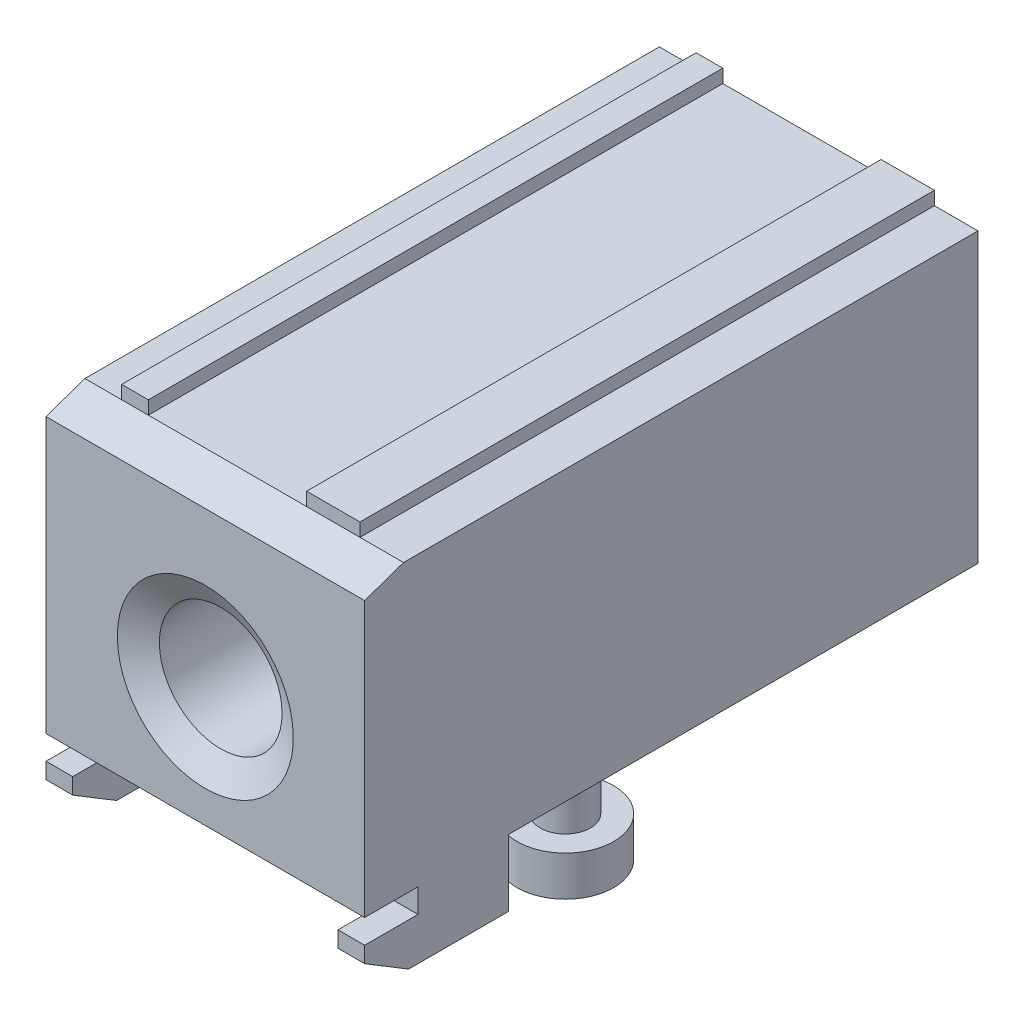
ISO-10303-21;
HEADER;
FILE_DESCRIPTION(('STEP AP214'),'2;1');
FILE_NAME('part.step','',(''),(''),'','','');
FILE_SCHEMA(('AUTOMOTIVE_DESIGN { 1 0 10303 214 1 1 1 1 }'));
ENDSEC;
DATA;
#1=APPLICATION_CONTEXT('core data for automotive mechanical design processes');
#2=APPLICATION_PROTOCOL_DEFINITION('international standard','automotive_design',2000,#1);
#3=PRODUCT_CONTEXT('',#1,'mechanical');
#4=PRODUCT('Part','Part','',(#3));
#5=PRODUCT_RELATED_PRODUCT_CATEGORY('part','',(#4));
#6=PRODUCT_DEFINITION_FORMATION('','',#4);
#7=PRODUCT_DEFINITION_CONTEXT('part definition',#1,'design');
#8=PRODUCT_DEFINITION('design','',#6,#7);
#9=PRODUCT_DEFINITION_SHAPE('','',#8);
#10=(LENGTH_UNIT() NAMED_UNIT(*) SI_UNIT(.MILLI.,.METRE.));
#11=(NAMED_UNIT(*) PLANE_ANGLE_UNIT() SI_UNIT($,.RADIAN.));
#12=(NAMED_UNIT(*) SI_UNIT($,.STERADIAN.) SOLID_ANGLE_UNIT());
#13=UNCERTAINTY_MEASURE_WITH_UNIT(LENGTH_MEASURE(1.E-05),#10,'distance_accuracy_value','');
#14=(GEOMETRIC_REPRESENTATION_CONTEXT(3) GLOBAL_UNCERTAINTY_ASSIGNED_CONTEXT((#13)) GLOBAL_UNIT_ASSIGNED_CONTEXT((#10,
#11,#12)) REPRESENTATION_CONTEXT('',''));
#15=CARTESIAN_POINT('',(0.,0.,0.));
#16=DIRECTION('',(0.,0.,1.));
#17=DIRECTION('',(1.,0.,0.));
#18=AXIS2_PLACEMENT_3D('',#15,#16,#17);
#19=CARTESIAN_POINT('',(-5.975,0.,9.5));
#20=DIRECTION('',(0.,1.,0.));
#21=DIRECTION('',(0.,0.,1.));
#22=AXIS2_PLACEMENT_3D('',#19,#20,#21);
#23=PLANE('',#22);
#24=CARTESIAN_POINT('',(-4.,0.,0.));
#25=DIRECTION('',(0.,1.,0.));
#26=DIRECTION('',(0.,0.,1.));
#27=AXIS2_PLACEMENT_3D('',#24,#25,#26);
#28=CIRCLE('',#27,0.94);
#29=CARTESIAN_POINT('',(-4.,0.,0.94));
#30=VERTEX_POINT('',#29);
#31=EDGE_CURVE('E23',#30,#30,#28,.F.);
#32=ORIENTED_EDGE('',*,*,#31,.F.);
#33=EDGE_LOOP('',(#32));
#34=FACE_BOUND('',#33,.T.);
#35=CARTESIAN_POINT('',(0.,0.,0.));
#36=DIRECTION('',(0.,1.,0.));
#37=DIRECTION('',(0.,0.,1.));
#38=AXIS2_PLACEMENT_3D('',#35,#36,#37);
#39=CIRCLE('',#38,1.025);
#40=CARTESIAN_POINT('',(0.,0.,1.025));
#41=VERTEX_POINT('',#40);
#42=EDGE_CURVE('E558',#41,#41,#39,.F.);
#43=ORIENTED_EDGE('',*,*,#42,.F.);
#44=EDGE_LOOP('',(#43));
#45=FACE_BOUND('',#44,.T.);
#46=DIRECTION('',(-1.,0.,0.));
#47=VECTOR('',#46,1.);
#48=CARTESIAN_POINT('',(-4.975,0.,7.5));
#49=LINE('',#48,#47);
#50=CARTESIAN_POINT('',(-4.975,0.,7.5));
#51=VERTEX_POINT('',#50);
#52=CARTESIAN_POINT('',(-5.975,0.,7.5));
#53=VERTEX_POINT('',#52);
#54=EDGE_CURVE('E312',#51,#53,#49,.T.);
#55=ORIENTED_EDGE('',*,*,#54,.F.);
#56=DIRECTION('',(0.,0.,1.));
#57=VECTOR('',#56,1.);
#58=CARTESIAN_POINT('',(-4.975,0.,7.5));
#59=LINE('',#58,#57);
#60=CARTESIAN_POINT('',(-4.975,0.,4.1));
#61=VERTEX_POINT('',#60);
#62=EDGE_CURVE('E438',#61,#51,#59,.T.);
#63=ORIENTED_EDGE('',*,*,#62,.F.);
#64=DIRECTION('',(-1.,0.,0.));
#65=VECTOR('',#64,1.);
#66=CARTESIAN_POINT('',(-4.975,0.,4.1));
#67=LINE('',#66,#65);
#68=CARTESIAN_POINT('',(-5.975,0.,4.1));
#69=VERTEX_POINT('',#68);
#70=EDGE_CURVE('E336',#61,#69,#67,.T.);
#71=ORIENTED_EDGE('',*,*,#70,.T.);
#72=DIRECTION('',(0.,0.,1.));
#73=VECTOR('',#72,1.);
#74=CARTESIAN_POINT('',(-5.975,0.,-13.5));
#75=LINE('',#74,#73);
#76=CARTESIAN_POINT('',(-5.975,0.,-13.5));
#77=VERTEX_POINT('',#76);
#78=EDGE_CURVE('E290',#77,#69,#75,.T.);
#79=ORIENTED_EDGE('',*,*,#78,.F.);
#80=DIRECTION('',(-1.,0.,0.));
#81=VECTOR('',#80,1.);
#82=CARTESIAN_POINT('',(-5.975,0.,-13.5));
#83=LINE('',#82,#81);
#84=CARTESIAN_POINT('',(5.975,0.,-13.5));
#85=VERTEX_POINT('',#84);
#86=EDGE_CURVE('E233',#85,#77,#83,.T.);
#87=ORIENTED_EDGE('',*,*,#86,.F.);
#88=DIRECTION('',(0.,0.,-1.));
#89=VECTOR('',#88,1.);
#90=CARTESIAN_POINT('',(5.975,0.,-13.5));
#91=LINE('',#90,#89);
#92=CARTESIAN_POINT('',(5.975,0.,4.1));
#93=VERTEX_POINT('',#92);
#94=EDGE_CURVE('E234',#93,#85,#91,.T.);
#95=ORIENTED_EDGE('',*,*,#94,.F.);
#96=DIRECTION('',(1.,0.,0.));
#97=VECTOR('',#96,1.);
#98=CARTESIAN_POINT('',(4.975,0.,4.1));
#99=LINE('',#98,#97);
#100=CARTESIAN_POINT('',(4.975,0.,4.1));
#101=VERTEX_POINT('',#100);
#102=EDGE_CURVE('E276',#101,#93,#99,.T.);
#103=ORIENTED_EDGE('',*,*,#102,.F.);
#104=DIRECTION('',(0.,0.,1.));
#105=VECTOR('',#104,1.);
#106=CARTESIAN_POINT('',(4.975,0.,7.5));
#107=LINE('',#106,#105);
#108=CARTESIAN_POINT('',(4.975,0.,7.5));
#109=VERTEX_POINT('',#108);
#110=EDGE_CURVE('E272',#101,#109,#107,.T.);
#111=ORIENTED_EDGE('',*,*,#110,.T.);
#112=DIRECTION('',(1.,0.,0.));
#113=VECTOR('',#112,1.);
#114=CARTESIAN_POINT('',(4.975,0.,7.5));
#115=LINE('',#114,#113);
#116=CARTESIAN_POINT('',(5.975,0.,7.5));
#117=VERTEX_POINT('',#116);
#118=EDGE_CURVE('E280',#109,#117,#115,.T.);
#119=ORIENTED_EDGE('',*,*,#118,.T.);
#120=CARTESIAN_POINT('',(5.975,0.,9.5));
#121=VERTEX_POINT('',#120);
#122=EDGE_CURVE('E230',#121,#117,#91,.T.);
#123=ORIENTED_EDGE('',*,*,#122,.F.);
#124=DIRECTION('',(1.,0.,0.));
#125=VECTOR('',#124,1.);
#126=CARTESIAN_POINT('',(-5.975,0.,9.5));
#127=LINE('',#126,#125);
#128=CARTESIAN_POINT('',(-5.975,0.,9.5));
#129=VERTEX_POINT('',#128);
#130=EDGE_CURVE('E218',#129,#121,#127,.T.);
#131=ORIENTED_EDGE('',*,*,#130,.F.);
#132=EDGE_CURVE('E278',#53,#129,#75,.T.);
#133=ORIENTED_EDGE('',*,*,#132,.F.);
#134=EDGE_LOOP('',(#55,#63,#71,#79,#87,#95,#103,#111,#119,#123,#131,#133));
#135=FACE_BOUND('',#134,.T.);
#136=CARTESIAN_POINT('',(0.,0.,-5.88));
#137=DIRECTION('',(0.,1.,0.));
#138=DIRECTION('',(0.,0.,1.));
#139=AXIS2_PLACEMENT_3D('',#136,#137,#138);
#140=CIRCLE('',#139,1.025);
#141=CARTESIAN_POINT('',(0.,0.,-4.855));
#142=VERTEX_POINT('',#141);
#143=EDGE_CURVE('E561',#142,#142,#140,.F.);
#144=ORIENTED_EDGE('',*,*,#143,.F.);
#145=EDGE_LOOP('',(#144));
#146=FACE_BOUND('',#145,.T.);
#147=CARTESIAN_POINT('',(4.,0.,0.));
#148=DIRECTION('',(0.,1.,0.));
#149=DIRECTION('',(0.,0.,1.));
#150=AXIS2_PLACEMENT_3D('',#147,#148,#149);
#151=CIRCLE('',#150,0.94);
#152=CARTESIAN_POINT('',(4.,0.,0.940000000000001));
#153=VERTEX_POINT('',#152);
#154=EDGE_CURVE('E10',#153,#153,#151,.F.);
#155=ORIENTED_EDGE('',*,*,#154,.F.);
#156=EDGE_LOOP('',(#155));
#157=FACE_BOUND('',#156,.T.);
#158=ADVANCED_FACE('F15',(#34,#45,#135,#146,#157),#23,.F.);
#159=CARTESIAN_POINT('',(-5.975,10.8,9.5));
#160=DIRECTION('',(0.,1.,0.));
#161=DIRECTION('',(0.,0.,1.));
#162=AXIS2_PLACEMENT_3D('',#159,#160,#161);
#163=PLANE('',#162);
#164=DIRECTION('',(1.,0.,0.));
#165=VECTOR('',#164,1.);
#166=CARTESIAN_POINT('',(-5.975025,10.8,8.04206000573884));
#167=LINE('',#166,#165);
#168=CARTESIAN_POINT('',(-3.59489631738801,10.8,8.04206000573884));
#169=VERTEX_POINT('',#168);
#170=CARTESIAN_POINT('',(2.3401880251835,10.8,8.04206000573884));
#171=VERTEX_POINT('',#170);
#172=EDGE_CURVE('E922',#169,#171,#167,.T.);
#173=ORIENTED_EDGE('',*,*,#172,.T.);
#174=DIRECTION('',(0.,0.,1.));
#175=VECTOR('',#174,1.);
#176=CARTESIAN_POINT('',(2.3401880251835,10.8,-14.6180339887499));
#177=LINE('',#176,#175);
#178=CARTESIAN_POINT('',(2.3401880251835,10.8,-13.5));
#179=VERTEX_POINT('',#178);
#180=EDGE_CURVE('E533',#179,#171,#177,.T.);
#181=ORIENTED_EDGE('',*,*,#180,.F.);
#182=DIRECTION('',(-1.,0.,0.));
#183=VECTOR('',#182,1.);
#184=CARTESIAN_POINT('',(-5.975,10.8,-13.5));
#185=LINE('',#184,#183);
#186=CARTESIAN_POINT('',(-3.59489631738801,10.8,-13.5));
#187=VERTEX_POINT('',#186);
#188=EDGE_CURVE('E255',#179,#187,#185,.T.);
#189=ORIENTED_EDGE('',*,*,#188,.T.);
#190=DIRECTION('',(0.,0.,1.));
#191=VECTOR('',#190,1.);
#192=CARTESIAN_POINT('',(-3.59489631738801,10.8,-14.6180339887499));
#193=LINE('',#192,#191);
#194=EDGE_CURVE('E548',#187,#169,#193,.T.);
#195=ORIENTED_EDGE('',*,*,#194,.T.);
#196=EDGE_LOOP('',(#173,#181,#189,#195));
#197=FACE_BOUND('',#196,.T.);
#198=ADVANCED_FACE('F388',(#197),#163,.T.);
#199=CARTESIAN_POINT('',(4.34018802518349,10.8,8.04206000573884));
#200=VERTEX_POINT('',#199);
#201=CARTESIAN_POINT('',(5.975,10.8,8.04206000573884));
#202=VERTEX_POINT('',#201);
#203=EDGE_CURVE('E204',#200,#202,#167,.T.);
#204=ORIENTED_EDGE('',*,*,#203,.T.);
#205=DIRECTION('',(0.,0.,-1.));
#206=VECTOR('',#205,1.);
#207=CARTESIAN_POINT('',(5.975,10.8,-13.5));
#208=LINE('',#207,#206);
#209=CARTESIAN_POINT('',(5.975,10.8,-13.5));
#210=VERTEX_POINT('',#209);
#211=EDGE_CURVE('E213',#202,#210,#208,.T.);
#212=ORIENTED_EDGE('',*,*,#211,.T.);
#213=CARTESIAN_POINT('',(4.34018802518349,10.8,-13.5));
#214=VERTEX_POINT('',#213);
#215=EDGE_CURVE('E38',#210,#214,#185,.T.);
#216=ORIENTED_EDGE('',*,*,#215,.T.);
#217=DIRECTION('',(0.,0.,1.));
#218=VECTOR('',#217,1.);
#219=CARTESIAN_POINT('',(4.34018802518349,10.8,-14.6180339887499));
#220=LINE('',#219,#218);
#221=EDGE_CURVE('E530',#214,#200,#220,.T.);
#222=ORIENTED_EDGE('',*,*,#221,.T.);
#223=EDGE_LOOP('',(#204,#212,#216,#222));
#224=FACE_BOUND('',#223,.T.);
#225=ADVANCED_FACE('F394',(#224),#163,.T.);
#226=CARTESIAN_POINT('',(-5.975,10.8,-13.5));
#227=DIRECTION('',(1.,0.,0.));
#228=DIRECTION('',(0.,0.,-1.));
#229=AXIS2_PLACEMENT_3D('',#226,#227,#228);
#230=PLANE('',#229);
#231=DIRECTION('',(0.,-1.,0.));
#232=VECTOR('',#231,1.);
#233=CARTESIAN_POINT('',(-5.975,10.8,9.5));
#234=LINE('',#233,#232);
#235=CARTESIAN_POINT('',(-5.975,10.292836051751,9.5));
#236=VERTEX_POINT('',#235);
#237=EDGE_CURVE('E220',#236,#129,#234,.T.);
#238=ORIENTED_EDGE('',*,*,#237,.F.);
#239=DIRECTION('',(0.,0.3285520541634,-0.944485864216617));
#240=VECTOR('',#239,1.);
#241=CARTESIAN_POINT('',(-5.975,17.4847763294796,-11.1746110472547));
#242=LINE('',#241,#240);
#243=CARTESIAN_POINT('',(-5.975,10.8,8.04206000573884));
#244=VERTEX_POINT('',#243);
#245=EDGE_CURVE('E200',#236,#244,#242,.T.);
#246=ORIENTED_EDGE('',*,*,#245,.T.);
#247=DIRECTION('',(0.,0.,1.));
#248=VECTOR('',#247,1.);
#249=CARTESIAN_POINT('',(-5.975,10.8,-13.5));
#250=LINE('',#249,#248);
#251=CARTESIAN_POINT('',(-5.975,10.8,-13.5));
#252=VERTEX_POINT('',#251);
#253=EDGE_CURVE('E242',#252,#244,#250,.T.);
#254=ORIENTED_EDGE('',*,*,#253,.F.);
#255=DIRECTION('',(0.,-1.,0.));
#256=VECTOR('',#255,1.);
#257=CARTESIAN_POINT('',(-5.975,10.8,-13.5));
#258=LINE('',#257,#256);
#259=EDGE_CURVE('E226',#252,#77,#258,.T.);
#260=ORIENTED_EDGE('',*,*,#259,.T.);
#261=ORIENTED_EDGE('',*,*,#78,.T.);
#262=DIRECTION('',(0.,1.,0.));
#263=VECTOR('',#262,1.);
#264=CARTESIAN_POINT('',(-5.975,-2.5,4.1));
#265=LINE('',#264,#263);
#266=CARTESIAN_POINT('',(-5.975,-2.5,4.1));
#267=VERTEX_POINT('',#266);
#268=EDGE_CURVE('E265',#267,#69,#265,.T.);
#269=ORIENTED_EDGE('',*,*,#268,.F.);
#270=DIRECTION('',(0.,0.,-1.));
#271=VECTOR('',#270,1.);
#272=CARTESIAN_POINT('',(-5.975,-2.5,7.85124594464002));
#273=LINE('',#272,#271);
#274=CARTESIAN_POINT('',(-5.975,-2.5,7.85124594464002));
#275=VERTEX_POINT('',#274);
#276=EDGE_CURVE('E445',#275,#267,#273,.T.);
#277=ORIENTED_EDGE('',*,*,#276,.F.);
#278=DIRECTION('',(0.,-0.518588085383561,-0.855024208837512));
#279=VECTOR('',#278,1.);
#280=CARTESIAN_POINT('',(-5.975,-1.5,9.5));
#281=LINE('',#280,#279);
#282=CARTESIAN_POINT('',(-5.975,-1.5,9.5));
#283=VERTEX_POINT('',#282);
#284=EDGE_CURVE('E447',#283,#275,#281,.T.);
#285=ORIENTED_EDGE('',*,*,#284,.F.);
#286=DIRECTION('',(0.,-1.,0.));
#287=VECTOR('',#286,1.);
#288=CARTESIAN_POINT('',(-5.975,-0.9,9.5));
#289=LINE('',#288,#287);
#290=CARTESIAN_POINT('',(-5.975,-0.9,9.5));
#291=VERTEX_POINT('',#290);
#292=EDGE_CURVE('E454',#291,#283,#289,.T.);
#293=ORIENTED_EDGE('',*,*,#292,.F.);
#294=DIRECTION('',(0.,0.,1.));
#295=VECTOR('',#294,1.);
#296=CARTESIAN_POINT('',(-5.975,-0.9,7.5));
#297=LINE('',#296,#295);
#298=CARTESIAN_POINT('',(-5.975,-0.9,7.5));
#299=VERTEX_POINT('',#298);
#300=EDGE_CURVE('E456',#299,#291,#297,.T.);
#301=ORIENTED_EDGE('',*,*,#300,.F.);
#302=DIRECTION('',(0.,-1.,0.));
#303=VECTOR('',#302,1.);
#304=CARTESIAN_POINT('',(-5.975,0.,7.5));
#305=LINE('',#304,#303);
#306=EDGE_CURVE('E300',#53,#299,#305,.T.);
#307=ORIENTED_EDGE('',*,*,#306,.F.);
#308=ORIENTED_EDGE('',*,*,#132,.T.);
#309=EDGE_LOOP('',(#238,#246,#254,#260,#261,#269,#277,#285,#293,#301,#307,#308));
#310=FACE_BOUND('',#309,.T.);
#311=ADVANCED_FACE('F17',(#310),#230,.F.);
#312=CARTESIAN_POINT('',(-5.975,10.8,9.5));
#313=DIRECTION('',(0.,0.,-1.));
#314=DIRECTION('',(-1.,0.,0.));
#315=AXIS2_PLACEMENT_3D('',#312,#313,#314);
#316=PLANE('',#315);
#317=CARTESIAN_POINT('',(0.,4.5,9.5));
#318=DIRECTION('',(0.,0.,-1.));
#319=DIRECTION('',(-1.,0.,0.));
#320=AXIS2_PLACEMENT_3D('',#317,#318,#319);
#321=CIRCLE('',#320,3.3);
#322=CARTESIAN_POINT('',(-3.3,4.5,9.5));
#323=VERTEX_POINT('',#322);
#324=EDGE_CURVE('E256',#323,#323,#321,.T.);
#325=ORIENTED_EDGE('',*,*,#324,.T.);
#326=EDGE_LOOP('',(#325));
#327=FACE_BOUND('',#326,.T.);
#328=DIRECTION('',(0.,-1.,0.));
#329=VECTOR('',#328,1.);
#330=CARTESIAN_POINT('',(5.975,10.8,9.5));
#331=LINE('',#330,#329);
#332=CARTESIAN_POINT('',(5.975,10.292836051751,9.5));
#333=VERTEX_POINT('',#332);
#334=EDGE_CURVE('E210',#333,#121,#331,.T.);
#335=ORIENTED_EDGE('',*,*,#334,.F.);
#336=DIRECTION('',(1.,0.,0.));
#337=VECTOR('',#336,1.);
#338=CARTESIAN_POINT('',(-5.975025,10.292836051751,9.5));
#339=LINE('',#338,#337);
#340=EDGE_CURVE('E194',#236,#333,#339,.T.);
#341=ORIENTED_EDGE('',*,*,#340,.F.);
#342=ORIENTED_EDGE('',*,*,#237,.T.);
#343=ORIENTED_EDGE('',*,*,#130,.T.);
#344=EDGE_LOOP('',(#335,#341,#342,#343));
#345=FACE_BOUND('',#344,.T.);
#346=ADVANCED_FACE('F216',(#327,#345),#316,.F.);
#347=CARTESIAN_POINT('',(5.975,10.8,-13.5));
#348=DIRECTION('',(-1.,0.,0.));
#349=DIRECTION('',(0.,0.,1.));
#350=AXIS2_PLACEMENT_3D('',#347,#348,#349);
#351=PLANE('',#350);
#352=ORIENTED_EDGE('',*,*,#211,.F.);
#353=DIRECTION('',(0.,0.3285520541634,-0.944485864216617));
#354=VECTOR('',#353,1.);
#355=CARTESIAN_POINT('',(5.975,10.292836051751,9.5));
#356=LINE('',#355,#354);
#357=EDGE_CURVE('E197',#333,#202,#356,.T.);
#358=ORIENTED_EDGE('',*,*,#357,.F.);
#359=ORIENTED_EDGE('',*,*,#334,.T.);
#360=ORIENTED_EDGE('',*,*,#122,.T.);
#361=DIRECTION('',(0.,-1.,0.));
#362=VECTOR('',#361,1.);
#363=CARTESIAN_POINT('',(5.975,0.,7.5));
#364=LINE('',#363,#362);
#365=CARTESIAN_POINT('',(5.975,-0.9,7.5));
#366=VERTEX_POINT('',#365);
#367=EDGE_CURVE('E307',#117,#366,#364,.T.);
#368=ORIENTED_EDGE('',*,*,#367,.T.);
#369=DIRECTION('',(0.,0.,1.));
#370=VECTOR('',#369,1.);
#371=CARTESIAN_POINT('',(5.975,-0.9,7.5));
#372=LINE('',#371,#370);
#373=CARTESIAN_POINT('',(5.975,-0.9,9.5));
#374=VERTEX_POINT('',#373);
#375=EDGE_CURVE('E310',#366,#374,#372,.T.);
#376=ORIENTED_EDGE('',*,*,#375,.T.);
#377=DIRECTION('',(0.,-1.,0.));
#378=VECTOR('',#377,1.);
#379=CARTESIAN_POINT('',(5.975,-0.9,9.5));
#380=LINE('',#379,#378);
#381=CARTESIAN_POINT('',(5.975,-1.5,9.5));
#382=VERTEX_POINT('',#381);
#383=EDGE_CURVE('E313',#374,#382,#380,.T.);
#384=ORIENTED_EDGE('',*,*,#383,.T.);
#385=DIRECTION('',(0.,-0.518588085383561,-0.855024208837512));
#386=VECTOR('',#385,1.);
#387=CARTESIAN_POINT('',(5.975,-1.5,9.5));
#388=LINE('',#387,#386);
#389=CARTESIAN_POINT('',(5.975,-2.5,7.85124594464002));
#390=VERTEX_POINT('',#389);
#391=EDGE_CURVE('E340',#382,#390,#388,.T.);
#392=ORIENTED_EDGE('',*,*,#391,.T.);
#393=DIRECTION('',(0.,0.,-1.));
#394=VECTOR('',#393,1.);
#395=CARTESIAN_POINT('',(5.975,-2.5,7.85124594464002));
#396=LINE('',#395,#394);
#397=CARTESIAN_POINT('',(5.975,-2.5,4.1));
#398=VERTEX_POINT('',#397);
#399=EDGE_CURVE('E273',#390,#398,#396,.T.);
#400=ORIENTED_EDGE('',*,*,#399,.T.);
#401=DIRECTION('',(0.,1.,0.));
#402=VECTOR('',#401,1.);
#403=CARTESIAN_POINT('',(5.975,-2.5,4.1));
#404=LINE('',#403,#402);
#405=EDGE_CURVE('E269',#398,#93,#404,.T.);
#406=ORIENTED_EDGE('',*,*,#405,.T.);
#407=ORIENTED_EDGE('',*,*,#94,.T.);
#408=DIRECTION('',(0.,-1.,0.));
#409=VECTOR('',#408,1.);
#410=CARTESIAN_POINT('',(5.975,10.8,-13.5));
#411=LINE('',#410,#409);
#412=EDGE_CURVE('E221',#210,#85,#411,.T.);
#413=ORIENTED_EDGE('',*,*,#412,.F.);
#414=EDGE_LOOP('',(#352,#358,#359,#360,#368,#376,#384,#392,#400,#406,#407,#413));
#415=FACE_BOUND('',#414,.T.);
#416=ADVANCED_FACE('F208',(#415),#351,.F.);
#417=CARTESIAN_POINT('',(-5.975,10.8,-13.5));
#418=DIRECTION('',(0.,0.,1.));
#419=DIRECTION('',(1.,0.,0.));
#420=AXIS2_PLACEMENT_3D('',#417,#418,#419);
#421=PLANE('',#420);
#422=CARTESIAN_POINT('',(0.,4.5,-13.5));
#423=DIRECTION('',(0.,0.,1.));
#424=DIRECTION('',(1.,0.,0.));
#425=AXIS2_PLACEMENT_3D('',#422,#423,#424);
#426=CIRCLE('',#425,2.3);
#427=CARTESIAN_POINT('',(2.3,4.5,-13.5));
#428=VERTEX_POINT('',#427);
#429=EDGE_CURVE('E262',#428,#428,#426,.T.);
#430=ORIENTED_EDGE('',*,*,#429,.T.);
#431=EDGE_LOOP('',(#430));
#432=FACE_BOUND('',#431,.T.);
#433=ORIENTED_EDGE('',*,*,#86,.T.);
#434=ORIENTED_EDGE('',*,*,#259,.F.);
#435=CARTESIAN_POINT('',(-4.59489631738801,10.8,-13.5));
#436=VERTEX_POINT('',#435);
#437=EDGE_CURVE('E246',#436,#252,#185,.T.);
#438=ORIENTED_EDGE('',*,*,#437,.F.);
#439=DIRECTION('',(0.,1.,0.));
#440=VECTOR('',#439,1.);
#441=CARTESIAN_POINT('',(-4.59489631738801,10.8,-13.5));
#442=LINE('',#441,#440);
#443=CARTESIAN_POINT('',(-4.59489631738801,11.3,-13.5));
#444=VERTEX_POINT('',#443);
#445=EDGE_CURVE('E266',#436,#444,#442,.T.);
#446=ORIENTED_EDGE('',*,*,#445,.T.);
#447=DIRECTION('',(1.,0.,0.));
#448=VECTOR('',#447,1.);
#449=CARTESIAN_POINT('',(-4.59489631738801,11.3,-13.5));
#450=LINE('',#449,#448);
#451=CARTESIAN_POINT('',(-3.59489631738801,11.3,-13.5));
#452=VERTEX_POINT('',#451);
#453=EDGE_CURVE('E540',#444,#452,#450,.T.);
#454=ORIENTED_EDGE('',*,*,#453,.T.);
#455=DIRECTION('',(0.,-1.,0.));
#456=VECTOR('',#455,1.);
#457=CARTESIAN_POINT('',(-3.59489631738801,10.8,-13.5));
#458=LINE('',#457,#456);
#459=EDGE_CURVE('E542',#452,#187,#458,.T.);
#460=ORIENTED_EDGE('',*,*,#459,.T.);
#461=ORIENTED_EDGE('',*,*,#188,.F.);
#462=DIRECTION('',(0.,1.,0.));
#463=VECTOR('',#462,1.);
#464=CARTESIAN_POINT('',(2.3401880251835,10.8,-13.5));
#465=LINE('',#464,#463);
#466=CARTESIAN_POINT('',(2.3401880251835,11.3,-13.5));
#467=VERTEX_POINT('',#466);
#468=EDGE_CURVE('E941',#179,#467,#465,.T.);
#469=ORIENTED_EDGE('',*,*,#468,.T.);
#470=DIRECTION('',(1.,0.,0.));
#471=VECTOR('',#470,1.);
#472=CARTESIAN_POINT('',(2.3401880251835,11.3,-13.5));
#473=LINE('',#472,#471);
#474=CARTESIAN_POINT('',(4.34018802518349,11.3,-13.5));
#475=VERTEX_POINT('',#474);
#476=EDGE_CURVE('E523',#467,#475,#473,.T.);
#477=ORIENTED_EDGE('',*,*,#476,.T.);
#478=DIRECTION('',(0.,-1.,0.));
#479=VECTOR('',#478,1.);
#480=CARTESIAN_POINT('',(4.34018802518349,10.8,-13.5));
#481=LINE('',#480,#479);
#482=EDGE_CURVE('E520',#475,#214,#481,.T.);
#483=ORIENTED_EDGE('',*,*,#482,.T.);
#484=ORIENTED_EDGE('',*,*,#215,.F.);
#485=ORIENTED_EDGE('',*,*,#412,.T.);
#486=EDGE_LOOP('',(#433,#434,#438,#446,#454,#460,#461,#469,#477,#483,#484,#485));
#487=FACE_BOUND('',#486,.T.);
#488=ADVANCED_FACE('F403',(#432,#487),#421,.F.);
#489=CARTESIAN_POINT('',(-4.59489631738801,10.8,8.04206000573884));
#490=VERTEX_POINT('',#489);
#491=EDGE_CURVE('E921',#244,#490,#167,.T.);
#492=ORIENTED_EDGE('',*,*,#491,.T.);
#493=DIRECTION('',(0.,0.,1.));
#494=VECTOR('',#493,1.);
#495=CARTESIAN_POINT('',(-4.59489631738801,10.8,-14.6180339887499));
#496=LINE('',#495,#494);
#497=EDGE_CURVE('E553',#436,#490,#496,.T.);
#498=ORIENTED_EDGE('',*,*,#497,.F.);
#499=ORIENTED_EDGE('',*,*,#437,.T.);
#500=ORIENTED_EDGE('',*,*,#253,.T.);
#501=EDGE_LOOP('',(#492,#498,#499,#500));
#502=FACE_BOUND('',#501,.T.);
#503=ADVANCED_FACE('F397',(#502),#163,.T.);
#504=CARTESIAN_POINT('',(4.975,-2.5,4.1));
#505=DIRECTION('',(0.,0.,-1.));
#506=DIRECTION('',(0.,1.,0.));
#507=AXIS2_PLACEMENT_3D('',#504,#505,#506);
#508=PLANE('',#507);
#509=ORIENTED_EDGE('',*,*,#405,.F.);
#510=DIRECTION('',(1.,0.,0.));
#511=VECTOR('',#510,1.);
#512=CARTESIAN_POINT('',(4.975,-2.5,4.1));
#513=LINE('',#512,#511);
#514=CARTESIAN_POINT('',(4.975,-2.5,4.1));
#515=VERTEX_POINT('',#514);
#516=EDGE_CURVE('E279',#515,#398,#513,.T.);
#517=ORIENTED_EDGE('',*,*,#516,.F.);
#518=DIRECTION('',(0.,1.,0.));
#519=VECTOR('',#518,1.);
#520=CARTESIAN_POINT('',(4.975,-2.5,4.1));
#521=LINE('',#520,#519);
#522=EDGE_CURVE('E285',#515,#101,#521,.T.);
#523=ORIENTED_EDGE('',*,*,#522,.T.);
#524=ORIENTED_EDGE('',*,*,#102,.T.);
#525=EDGE_LOOP('',(#509,#517,#523,#524));
#526=FACE_BOUND('',#525,.T.);
#527=ADVANCED_FACE('F402',(#526),#508,.T.);
#528=CARTESIAN_POINT('',(4.975,-2.5,7.85124594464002));
#529=DIRECTION('',(0.,-1.,0.));
#530=DIRECTION('',(0.,0.,-1.));
#531=AXIS2_PLACEMENT_3D('',#528,#529,#530);
#532=PLANE('',#531);
#533=ORIENTED_EDGE('',*,*,#399,.F.);
#534=DIRECTION('',(1.,0.,0.));
#535=VECTOR('',#534,1.);
#536=CARTESIAN_POINT('',(4.975,-2.5,7.85124594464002));
#537=LINE('',#536,#535);
#538=CARTESIAN_POINT('',(4.975,-2.5,7.85124594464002));
#539=VERTEX_POINT('',#538);
#540=EDGE_CURVE('E364',#539,#390,#537,.T.);
#541=ORIENTED_EDGE('',*,*,#540,.F.);
#542=DIRECTION('',(0.,0.,-1.));
#543=VECTOR('',#542,1.);
#544=CARTESIAN_POINT('',(4.975,-2.5,7.85124594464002));
#545=LINE('',#544,#543);
#546=EDGE_CURVE('E358',#539,#515,#545,.T.);
#547=ORIENTED_EDGE('',*,*,#546,.T.);
#548=ORIENTED_EDGE('',*,*,#516,.T.);
#549=EDGE_LOOP('',(#533,#541,#547,#548));
#550=FACE_BOUND('',#549,.T.);
#551=ADVANCED_FACE('F502',(#550),#532,.T.);
#552=CARTESIAN_POINT('',(4.975,-1.5,9.5));
#553=DIRECTION('',(0.,-0.855024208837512,0.518588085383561));
#554=DIRECTION('',(0.,-0.518588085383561,-0.855024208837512));
#555=AXIS2_PLACEMENT_3D('',#552,#553,#554);
#556=PLANE('',#555);
#557=ORIENTED_EDGE('',*,*,#391,.F.);
#558=DIRECTION('',(1.,0.,0.));
#559=VECTOR('',#558,1.);
#560=CARTESIAN_POINT('',(4.975,-1.5,9.5));
#561=LINE('',#560,#559);
#562=CARTESIAN_POINT('',(4.975,-1.5,9.5));
#563=VERTEX_POINT('',#562);
#564=EDGE_CURVE('E366',#563,#382,#561,.T.);
#565=ORIENTED_EDGE('',*,*,#564,.F.);
#566=DIRECTION('',(0.,-0.518588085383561,-0.855024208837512));
#567=VECTOR('',#566,1.);
#568=CARTESIAN_POINT('',(4.975,-1.5,9.5));
#569=LINE('',#568,#567);
#570=EDGE_CURVE('E355',#563,#539,#569,.T.);
#571=ORIENTED_EDGE('',*,*,#570,.T.);
#572=ORIENTED_EDGE('',*,*,#540,.T.);
#573=EDGE_LOOP('',(#557,#565,#571,#572));
#574=FACE_BOUND('',#573,.T.);
#575=ADVANCED_FACE('F384',(#574),#556,.T.);
#576=CARTESIAN_POINT('',(4.975,-0.9,9.5));
#577=DIRECTION('',(0.,0.,1.));
#578=DIRECTION('',(1.,0.,0.));
#579=AXIS2_PLACEMENT_3D('',#576,#577,#578);
#580=PLANE('',#579);
#581=ORIENTED_EDGE('',*,*,#383,.F.);
#582=DIRECTION('',(1.,0.,0.));
#583=VECTOR('',#582,1.);
#584=CARTESIAN_POINT('',(4.975,-0.9,9.5));
#585=LINE('',#584,#583);
#586=CARTESIAN_POINT('',(4.975,-0.9,9.5));
#587=VERTEX_POINT('',#586);
#588=EDGE_CURVE('E367',#587,#374,#585,.T.);
#589=ORIENTED_EDGE('',*,*,#588,.F.);
#590=DIRECTION('',(0.,-1.,0.));
#591=VECTOR('',#590,1.);
#592=CARTESIAN_POINT('',(4.975,-0.9,9.5));
#593=LINE('',#592,#591);
#594=EDGE_CURVE('E352',#587,#563,#593,.T.);
#595=ORIENTED_EDGE('',*,*,#594,.T.);
#596=ORIENTED_EDGE('',*,*,#564,.T.);
#597=EDGE_LOOP('',(#581,#589,#595,#596));
#598=FACE_BOUND('',#597,.T.);
#599=ADVANCED_FACE('F375',(#598),#580,.T.);
#600=CARTESIAN_POINT('',(4.975,-0.9,7.5));
#601=DIRECTION('',(0.,1.,0.));
#602=DIRECTION('',(0.,0.,1.));
#603=AXIS2_PLACEMENT_3D('',#600,#601,#602);
#604=PLANE('',#603);
#605=ORIENTED_EDGE('',*,*,#375,.F.);
#606=DIRECTION('',(1.,0.,0.));
#607=VECTOR('',#606,1.);
#608=CARTESIAN_POINT('',(4.975,-0.9,7.5));
#609=LINE('',#608,#607);
#610=CARTESIAN_POINT('',(4.975,-0.9,7.5));
#611=VERTEX_POINT('',#610);
#612=EDGE_CURVE('E284',#611,#366,#609,.T.);
#613=ORIENTED_EDGE('',*,*,#612,.F.);
#614=DIRECTION('',(0.,0.,1.));
#615=VECTOR('',#614,1.);
#616=CARTESIAN_POINT('',(4.975,-0.9,7.5));
#617=LINE('',#616,#615);
#618=EDGE_CURVE('E349',#611,#587,#617,.T.);
#619=ORIENTED_EDGE('',*,*,#618,.T.);
#620=ORIENTED_EDGE('',*,*,#588,.T.);
#621=EDGE_LOOP('',(#605,#613,#619,#620));
#622=FACE_BOUND('',#621,.T.);
#623=ADVANCED_FACE('F373',(#622),#604,.T.);
#624=CARTESIAN_POINT('',(4.975,0.,7.5));
#625=DIRECTION('',(0.,0.,1.));
#626=DIRECTION('',(1.,0.,0.));
#627=AXIS2_PLACEMENT_3D('',#624,#625,#626);
#628=PLANE('',#627);
#629=ORIENTED_EDGE('',*,*,#367,.F.);
#630=ORIENTED_EDGE('',*,*,#118,.F.);
#631=DIRECTION('',(0.,-1.,0.));
#632=VECTOR('',#631,1.);
#633=CARTESIAN_POINT('',(4.975,0.,7.5));
#634=LINE('',#633,#632);
#635=EDGE_CURVE('E346',#109,#611,#634,.T.);
#636=ORIENTED_EDGE('',*,*,#635,.T.);
#637=ORIENTED_EDGE('',*,*,#612,.T.);
#638=EDGE_LOOP('',(#629,#630,#636,#637));
#639=FACE_BOUND('',#638,.T.);
#640=ADVANCED_FACE('F370',(#639),#628,.T.);
#641=CARTESIAN_POINT('',(4.975,0.,9.5));
#642=DIRECTION('',(-1.,0.,0.));
#643=DIRECTION('',(0.,0.,1.));
#644=AXIS2_PLACEMENT_3D('',#641,#642,#643);
#645=PLANE('',#644);
#646=ORIENTED_EDGE('',*,*,#110,.F.);
#647=ORIENTED_EDGE('',*,*,#522,.F.);
#648=ORIENTED_EDGE('',*,*,#546,.F.);
#649=ORIENTED_EDGE('',*,*,#570,.F.);
#650=ORIENTED_EDGE('',*,*,#594,.F.);
#651=ORIENTED_EDGE('',*,*,#618,.F.);
#652=ORIENTED_EDGE('',*,*,#635,.F.);
#653=EDGE_LOOP('',(#646,#647,#648,#649,#650,#651,#652));
#654=FACE_BOUND('',#653,.T.);
#655=ADVANCED_FACE('F382',(#654),#645,.T.);
#656=CARTESIAN_POINT('',(-4.975,0.,7.5));
#657=DIRECTION('',(0.,0.,-1.));
#658=DIRECTION('',(-1.,0.,0.));
#659=AXIS2_PLACEMENT_3D('',#656,#657,#658);
#660=PLANE('',#659);
#661=ORIENTED_EDGE('',*,*,#306,.T.);
#662=DIRECTION('',(-1.,0.,0.));
#663=VECTOR('',#662,1.);
#664=CARTESIAN_POINT('',(-4.975,-0.9,7.5));
#665=LINE('',#664,#663);
#666=CARTESIAN_POINT('',(-4.975,-0.9,7.5));
#667=VERTEX_POINT('',#666);
#668=EDGE_CURVE('E315',#667,#299,#665,.T.);
#669=ORIENTED_EDGE('',*,*,#668,.F.);
#670=DIRECTION('',(0.,-1.,0.));
#671=VECTOR('',#670,1.);
#672=CARTESIAN_POINT('',(-4.975,0.,7.5));
#673=LINE('',#672,#671);
#674=EDGE_CURVE('E322',#51,#667,#673,.T.);
#675=ORIENTED_EDGE('',*,*,#674,.F.);
#676=ORIENTED_EDGE('',*,*,#54,.T.);
#677=EDGE_LOOP('',(#661,#669,#675,#676));
#678=FACE_BOUND('',#677,.T.);
#679=ADVANCED_FACE('F471',(#678),#660,.F.);
#680=CARTESIAN_POINT('',(-4.975,-0.9,7.5));
#681=DIRECTION('',(0.,-1.,0.));
#682=DIRECTION('',(0.,0.,-1.));
#683=AXIS2_PLACEMENT_3D('',#680,#681,#682);
#684=PLANE('',#683);
#685=ORIENTED_EDGE('',*,*,#300,.T.);
#686=DIRECTION('',(-1.,0.,0.));
#687=VECTOR('',#686,1.);
#688=CARTESIAN_POINT('',(-4.975,-0.9,9.5));
#689=LINE('',#688,#687);
#690=CARTESIAN_POINT('',(-4.975,-0.9,9.5));
#691=VERTEX_POINT('',#690);
#692=EDGE_CURVE('E319',#691,#291,#689,.T.);
#693=ORIENTED_EDGE('',*,*,#692,.F.);
#694=DIRECTION('',(0.,0.,1.));
#695=VECTOR('',#694,1.);
#696=CARTESIAN_POINT('',(-4.975,-0.9,7.5));
#697=LINE('',#696,#695);
#698=EDGE_CURVE('E466',#667,#691,#697,.T.);
#699=ORIENTED_EDGE('',*,*,#698,.F.);
#700=ORIENTED_EDGE('',*,*,#668,.T.);
#701=EDGE_LOOP('',(#685,#693,#699,#700));
#702=FACE_BOUND('',#701,.T.);
#703=ADVANCED_FACE('F473',(#702),#684,.F.);
#704=CARTESIAN_POINT('',(-4.975,-0.9,9.5));
#705=DIRECTION('',(0.,0.,-1.));
#706=DIRECTION('',(-1.,0.,0.));
#707=AXIS2_PLACEMENT_3D('',#704,#705,#706);
#708=PLANE('',#707);
#709=ORIENTED_EDGE('',*,*,#292,.T.);
#710=DIRECTION('',(-1.,0.,0.));
#711=VECTOR('',#710,1.);
#712=CARTESIAN_POINT('',(-4.975,-1.5,9.5));
#713=LINE('',#712,#711);
#714=CARTESIAN_POINT('',(-4.975,-1.5,9.5));
#715=VERTEX_POINT('',#714);
#716=EDGE_CURVE('E327',#715,#283,#713,.T.);
#717=ORIENTED_EDGE('',*,*,#716,.F.);
#718=DIRECTION('',(0.,-1.,0.));
#719=VECTOR('',#718,1.);
#720=CARTESIAN_POINT('',(-4.975,-0.9,9.5));
#721=LINE('',#720,#719);
#722=EDGE_CURVE('E465',#691,#715,#721,.T.);
#723=ORIENTED_EDGE('',*,*,#722,.F.);
#724=ORIENTED_EDGE('',*,*,#692,.T.);
#725=EDGE_LOOP('',(#709,#717,#723,#724));
#726=FACE_BOUND('',#725,.T.);
#727=ADVANCED_FACE('F478',(#726),#708,.F.);
#728=CARTESIAN_POINT('',(-4.975,-1.5,9.5));
#729=DIRECTION('',(0.,0.855024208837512,-0.518588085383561));
#730=DIRECTION('',(0.,0.518588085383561,0.855024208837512));
#731=AXIS2_PLACEMENT_3D('',#728,#729,#730);
#732=PLANE('',#731);
#733=ORIENTED_EDGE('',*,*,#284,.T.);
#734=DIRECTION('',(-1.,0.,0.));
#735=VECTOR('',#734,1.);
#736=CARTESIAN_POINT('',(-4.975,-2.5,7.85124594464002));
#737=LINE('',#736,#735);
#738=CARTESIAN_POINT('',(-4.975,-2.5,7.85124594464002));
#739=VERTEX_POINT('',#738);
#740=EDGE_CURVE('E330',#739,#275,#737,.T.);
#741=ORIENTED_EDGE('',*,*,#740,.F.);
#742=DIRECTION('',(0.,-0.518588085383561,-0.855024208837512));
#743=VECTOR('',#742,1.);
#744=CARTESIAN_POINT('',(-4.975,-1.5,9.5));
#745=LINE('',#744,#743);
#746=EDGE_CURVE('E463',#715,#739,#745,.T.);
#747=ORIENTED_EDGE('',*,*,#746,.F.);
#748=ORIENTED_EDGE('',*,*,#716,.T.);
#749=EDGE_LOOP('',(#733,#741,#747,#748));
#750=FACE_BOUND('',#749,.T.);
#751=ADVANCED_FACE('F483',(#750),#732,.F.);
#752=CARTESIAN_POINT('',(-4.975,-2.5,7.85124594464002));
#753=DIRECTION('',(0.,1.,0.));
#754=DIRECTION('',(0.,0.,1.));
#755=AXIS2_PLACEMENT_3D('',#752,#753,#754);
#756=PLANE('',#755);
#757=ORIENTED_EDGE('',*,*,#276,.T.);
#758=DIRECTION('',(-1.,0.,0.));
#759=VECTOR('',#758,1.);
#760=CARTESIAN_POINT('',(-4.975,-2.5,4.1));
#761=LINE('',#760,#759);
#762=CARTESIAN_POINT('',(-4.975,-2.5,4.1));
#763=VERTEX_POINT('',#762);
#764=EDGE_CURVE('E333',#763,#267,#761,.T.);
#765=ORIENTED_EDGE('',*,*,#764,.F.);
#766=DIRECTION('',(0.,0.,-1.));
#767=VECTOR('',#766,1.);
#768=CARTESIAN_POINT('',(-4.975,-2.5,7.85124594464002));
#769=LINE('',#768,#767);
#770=EDGE_CURVE('E461',#739,#763,#769,.T.);
#771=ORIENTED_EDGE('',*,*,#770,.F.);
#772=ORIENTED_EDGE('',*,*,#740,.T.);
#773=EDGE_LOOP('',(#757,#765,#771,#772));
#774=FACE_BOUND('',#773,.T.);
#775=ADVANCED_FACE('F486',(#774),#756,.F.);
#776=CARTESIAN_POINT('',(-4.975,-2.5,4.1));
#777=DIRECTION('',(0.,0.,1.));
#778=DIRECTION('',(0.,-1.,0.));
#779=AXIS2_PLACEMENT_3D('',#776,#777,#778);
#780=PLANE('',#779);
#781=ORIENTED_EDGE('',*,*,#268,.T.);
#782=ORIENTED_EDGE('',*,*,#70,.F.);
#783=DIRECTION('',(0.,1.,0.));
#784=VECTOR('',#783,1.);
#785=CARTESIAN_POINT('',(-4.975,-2.5,4.1));
#786=LINE('',#785,#784);
#787=EDGE_CURVE('E442',#763,#61,#786,.T.);
#788=ORIENTED_EDGE('',*,*,#787,.F.);
#789=ORIENTED_EDGE('',*,*,#764,.T.);
#790=EDGE_LOOP('',(#781,#782,#788,#789));
#791=FACE_BOUND('',#790,.T.);
#792=ADVANCED_FACE('F441',(#791),#780,.F.);
#793=CARTESIAN_POINT('',(-4.975,0.,9.5));
#794=DIRECTION('',(1.,0.,0.));
#795=DIRECTION('',(0.,0.,1.));
#796=AXIS2_PLACEMENT_3D('',#793,#794,#795);
#797=PLANE('',#796);
#798=ORIENTED_EDGE('',*,*,#62,.T.);
#799=ORIENTED_EDGE('',*,*,#674,.T.);
#800=ORIENTED_EDGE('',*,*,#698,.T.);
#801=ORIENTED_EDGE('',*,*,#722,.T.);
#802=ORIENTED_EDGE('',*,*,#746,.T.);
#803=ORIENTED_EDGE('',*,*,#770,.T.);
#804=ORIENTED_EDGE('',*,*,#787,.T.);
#805=EDGE_LOOP('',(#798,#799,#800,#801,#802,#803,#804));
#806=FACE_BOUND('',#805,.T.);
#807=ADVANCED_FACE('F426',(#806),#797,.T.);
#808=CARTESIAN_POINT('',(0.,4.5,-13.500025));
#809=DIRECTION('',(0.,0.,1.));
#810=DIRECTION('',(1.,0.,0.));
#811=AXIS2_PLACEMENT_3D('',#808,#809,#810);
#812=CYLINDRICAL_SURFACE('',#811,2.3);
#813=CARTESIAN_POINT('',(0.,4.5,8.92264973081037));
#814=DIRECTION('',(0.,0.,-1.));
#815=DIRECTION('',(-1.,0.,0.));
#816=AXIS2_PLACEMENT_3D('',#813,#814,#815);
#817=CIRCLE('',#816,2.3);
#818=CARTESIAN_POINT('',(-2.3,4.5,8.92264973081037));
#819=VERTEX_POINT('',#818);
#820=EDGE_CURVE('E223',#819,#819,#817,.F.);
#821=ORIENTED_EDGE('',*,*,#820,.T.);
#822=EDGE_LOOP('',(#821));
#823=FACE_BOUND('',#822,.T.);
#824=ORIENTED_EDGE('',*,*,#429,.F.);
#825=EDGE_LOOP('',(#824));
#826=FACE_BOUND('',#825,.T.);
#827=ADVANCED_FACE('F420',(#823,#826),#812,.F.);
#828=CARTESIAN_POINT('',(0.,4.5,8.92264973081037));
#829=DIRECTION('',(0.,0.,1.));
#830=DIRECTION('',(1.,0.,0.));
#831=AXIS2_PLACEMENT_3D('',#828,#829,#830);
#832=CONICAL_SURFACE('',#831,2.3,1.0471975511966);
#833=ORIENTED_EDGE('',*,*,#324,.F.);
#834=EDGE_LOOP('',(#833));
#835=FACE_BOUND('',#834,.T.);
#836=ORIENTED_EDGE('',*,*,#820,.F.);
#837=EDGE_LOOP('',(#836));
#838=FACE_BOUND('',#837,.T.);
#839=ADVANCED_FACE('F416',(#835,#838),#832,.F.);
#840=CARTESIAN_POINT('',(-4.59489631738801,10.8,-14.6180339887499));
#841=DIRECTION('',(-1.,0.,0.));
#842=DIRECTION('',(0.,0.,1.));
#843=AXIS2_PLACEMENT_3D('',#840,#841,#842);
#844=PLANE('',#843);
#845=DIRECTION('',(0.,-1.,0.));
#846=VECTOR('',#845,1.);
#847=CARTESIAN_POINT('',(-4.59489631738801,10.8000000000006,8.04206000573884));
#848=LINE('',#847,#846);
#849=CARTESIAN_POINT('',(-4.59489631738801,11.3,8.04206000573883));
#850=VERTEX_POINT('',#849);
#851=EDGE_CURVE('E946',#850,#490,#848,.T.);
#852=ORIENTED_EDGE('',*,*,#851,.F.);
#853=DIRECTION('',(0.,0.,1.));
#854=VECTOR('',#853,1.);
#855=CARTESIAN_POINT('',(-4.59489631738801,11.3,-14.6180339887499));
#856=LINE('',#855,#854);
#857=EDGE_CURVE('E543',#444,#850,#856,.T.);
#858=ORIENTED_EDGE('',*,*,#857,.F.);
#859=ORIENTED_EDGE('',*,*,#445,.F.);
#860=ORIENTED_EDGE('',*,*,#497,.T.);
#861=EDGE_LOOP('',(#852,#858,#859,#860));
#862=FACE_BOUND('',#861,.T.);
#863=ADVANCED_FACE('F419',(#862),#844,.T.);
#864=CARTESIAN_POINT('',(-4.59489631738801,11.3,-14.6180339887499));
#865=DIRECTION('',(0.,1.,0.));
#866=DIRECTION('',(0.,0.,1.));
#867=AXIS2_PLACEMENT_3D('',#864,#865,#866);
#868=PLANE('',#867);
#869=DIRECTION('',(1.,0.,0.));
#870=VECTOR('',#869,1.);
#871=CARTESIAN_POINT('',(-5.975025,11.3,8.04206000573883));
#872=LINE('',#871,#870);
#873=CARTESIAN_POINT('',(-3.59489631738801,11.3,8.04206000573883));
#874=VERTEX_POINT('',#873);
#875=EDGE_CURVE('E929',#850,#874,#872,.T.);
#876=ORIENTED_EDGE('',*,*,#875,.T.);
#877=DIRECTION('',(0.,0.,1.));
#878=VECTOR('',#877,1.);
#879=CARTESIAN_POINT('',(-3.59489631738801,11.3,-14.6180339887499));
#880=LINE('',#879,#878);
#881=EDGE_CURVE('E546',#452,#874,#880,.T.);
#882=ORIENTED_EDGE('',*,*,#881,.F.);
#883=ORIENTED_EDGE('',*,*,#453,.F.);
#884=ORIENTED_EDGE('',*,*,#857,.T.);
#885=EDGE_LOOP('',(#876,#882,#883,#884));
#886=FACE_BOUND('',#885,.T.);
#887=ADVANCED_FACE('F615',(#886),#868,.T.);
#888=CARTESIAN_POINT('',(-3.59489631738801,10.8,-14.6180339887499));
#889=DIRECTION('',(1.,0.,0.));
#890=DIRECTION('',(0.,0.,-1.));
#891=AXIS2_PLACEMENT_3D('',#888,#889,#890);
#892=PLANE('',#891);
#893=DIRECTION('',(0.,1.,0.));
#894=VECTOR('',#893,1.);
#895=CARTESIAN_POINT('',(-3.59489631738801,10.8000000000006,8.04206000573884));
#896=LINE('',#895,#894);
#897=EDGE_CURVE('E944',#169,#874,#896,.T.);
#898=ORIENTED_EDGE('',*,*,#897,.F.);
#899=ORIENTED_EDGE('',*,*,#194,.F.);
#900=ORIENTED_EDGE('',*,*,#459,.F.);
#901=ORIENTED_EDGE('',*,*,#881,.T.);
#902=EDGE_LOOP('',(#898,#899,#900,#901));
#903=FACE_BOUND('',#902,.T.);
#904=ADVANCED_FACE('F613',(#903),#892,.T.);
#905=CARTESIAN_POINT('',(2.3401880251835,10.8,-14.6180339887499));
#906=DIRECTION('',(-1.,0.,0.));
#907=DIRECTION('',(0.,-1.,0.));
#908=AXIS2_PLACEMENT_3D('',#905,#906,#907);
#909=PLANE('',#908);
#910=DIRECTION('',(0.,-1.,0.));
#911=VECTOR('',#910,1.);
#912=CARTESIAN_POINT('',(2.3401880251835,10.8000000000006,8.04206000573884));
#913=LINE('',#912,#911);
#914=CARTESIAN_POINT('',(2.3401880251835,11.3,8.04206000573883));
#915=VERTEX_POINT('',#914);
#916=EDGE_CURVE('E939',#915,#171,#913,.T.);
#917=ORIENTED_EDGE('',*,*,#916,.F.);
#918=DIRECTION('',(0.,0.,1.));
#919=VECTOR('',#918,1.);
#920=CARTESIAN_POINT('',(2.3401880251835,11.3,-14.6180339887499));
#921=LINE('',#920,#919);
#922=EDGE_CURVE('E527',#467,#915,#921,.T.);
#923=ORIENTED_EDGE('',*,*,#922,.F.);
#924=ORIENTED_EDGE('',*,*,#468,.F.);
#925=ORIENTED_EDGE('',*,*,#180,.T.);
#926=EDGE_LOOP('',(#917,#923,#924,#925));
#927=FACE_BOUND('',#926,.T.);
#928=ADVANCED_FACE('F607',(#927),#909,.T.);
#929=CARTESIAN_POINT('',(2.3401880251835,11.3,-14.6180339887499));
#930=DIRECTION('',(0.,1.,0.));
#931=DIRECTION('',(0.,0.,1.));
#932=AXIS2_PLACEMENT_3D('',#929,#930,#931);
#933=PLANE('',#932);
#934=CARTESIAN_POINT('',(4.34018802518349,11.3,8.04206000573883));
#935=VERTEX_POINT('',#934);
#936=EDGE_CURVE('E925',#915,#935,#872,.T.);
#937=ORIENTED_EDGE('',*,*,#936,.T.);
#938=DIRECTION('',(0.,0.,1.));
#939=VECTOR('',#938,1.);
#940=CARTESIAN_POINT('',(4.34018802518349,11.3,-14.6180339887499));
#941=LINE('',#940,#939);
#942=EDGE_CURVE('E532',#475,#935,#941,.T.);
#943=ORIENTED_EDGE('',*,*,#942,.F.);
#944=ORIENTED_EDGE('',*,*,#476,.F.);
#945=ORIENTED_EDGE('',*,*,#922,.T.);
#946=EDGE_LOOP('',(#937,#943,#944,#945));
#947=FACE_BOUND('',#946,.T.);
#948=ADVANCED_FACE('F604',(#947),#933,.T.);
#949=CARTESIAN_POINT('',(4.34018802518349,10.8,-14.6180339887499));
#950=DIRECTION('',(1.,0.,0.));
#951=DIRECTION('',(0.,0.,-1.));
#952=AXIS2_PLACEMENT_3D('',#949,#950,#951);
#953=PLANE('',#952);
#954=DIRECTION('',(0.,1.,0.));
#955=VECTOR('',#954,1.);
#956=CARTESIAN_POINT('',(4.34018802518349,10.8000000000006,8.04206000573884));
#957=LINE('',#956,#955);
#958=EDGE_CURVE('E259',#200,#935,#957,.T.);
#959=ORIENTED_EDGE('',*,*,#958,.F.);
#960=ORIENTED_EDGE('',*,*,#221,.F.);
#961=ORIENTED_EDGE('',*,*,#482,.F.);
#962=ORIENTED_EDGE('',*,*,#942,.T.);
#963=EDGE_LOOP('',(#959,#960,#961,#962));
#964=FACE_BOUND('',#963,.T.);
#965=ADVANCED_FACE('F531',(#964),#953,.T.);
#966=CARTESIAN_POINT('',(-5.975025,10.292836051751,9.5));
#967=DIRECTION('',(0.,-0.944485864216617,-0.3285520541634));
#968=DIRECTION('',(0.,0.3285520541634,-0.944485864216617));
#969=AXIS2_PLACEMENT_3D('',#966,#967,#968);
#970=PLANE('',#969);
#971=ORIENTED_EDGE('',*,*,#340,.T.);
#972=ORIENTED_EDGE('',*,*,#357,.T.);
#973=ORIENTED_EDGE('',*,*,#203,.F.);
#974=EDGE_CURVE('E30',#171,#200,#167,.T.);
#975=ORIENTED_EDGE('',*,*,#974,.F.);
#976=ORIENTED_EDGE('',*,*,#172,.F.);
#977=EDGE_CURVE('E926',#490,#169,#167,.T.);
#978=ORIENTED_EDGE('',*,*,#977,.F.);
#979=ORIENTED_EDGE('',*,*,#491,.F.);
#980=ORIENTED_EDGE('',*,*,#245,.F.);
#981=EDGE_LOOP('',(#971,#972,#973,#975,#976,#978,#979,#980));
#982=FACE_BOUND('',#981,.T.);
#983=ADVANCED_FACE('F196',(#982),#970,.F.);
#984=CARTESIAN_POINT('',(-5.975025,10.8,8.04206000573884));
#985=DIRECTION('',(0.,0.,-1.));
#986=DIRECTION('',(0.,1.,0.));
#987=AXIS2_PLACEMENT_3D('',#984,#985,#986);
#988=PLANE('',#987);
#989=ORIENTED_EDGE('',*,*,#851,.T.);
#990=ORIENTED_EDGE('',*,*,#977,.T.);
#991=ORIENTED_EDGE('',*,*,#897,.T.);
#992=ORIENTED_EDGE('',*,*,#875,.F.);
#993=EDGE_LOOP('',(#989,#990,#991,#992));
#994=FACE_BOUND('',#993,.T.);
#995=ADVANCED_FACE('F601',(#994),#988,.F.);
#996=ORIENTED_EDGE('',*,*,#916,.T.);
#997=ORIENTED_EDGE('',*,*,#974,.T.);
#998=ORIENTED_EDGE('',*,*,#958,.T.);
#999=ORIENTED_EDGE('',*,*,#936,.F.);
#1000=EDGE_LOOP('',(#996,#997,#998,#999));
#1001=FACE_BOUND('',#1000,.T.);
#1002=ADVANCED_FACE('F597',(#1001),#988,.F.);
#1003=CARTESIAN_POINT('',(0.,-3.175,0.));
#1004=DIRECTION('',(0.,1.,0.));
#1005=DIRECTION('',(0.,0.,1.));
#1006=AXIS2_PLACEMENT_3D('',#1003,#1004,#1005);
#1007=CYLINDRICAL_SURFACE('',#1006,1.025);
#1008=CARTESIAN_POINT('',(0.,-3.175,0.));
#1009=DIRECTION('',(0.,-1.,0.));
#1010=DIRECTION('',(0.,0.,-1.));
#1011=AXIS2_PLACEMENT_3D('',#1008,#1009,#1010);
#1012=CIRCLE('',#1011,1.025);
#1013=CARTESIAN_POINT('',(0.,-3.175,-1.025));
#1014=VERTEX_POINT('',#1013);
#1015=EDGE_CURVE('E214',#1014,#1014,#1012,.T.);
#1016=ORIENTED_EDGE('',*,*,#1015,.F.);
#1017=EDGE_LOOP('',(#1016));
#1018=FACE_BOUND('',#1017,.T.);
#1019=ORIENTED_EDGE('',*,*,#42,.T.);
#1020=EDGE_LOOP('',(#1019));
#1021=FACE_BOUND('',#1020,.T.);
#1022=ADVANCED_FACE('F589',(#1018,#1021),#1007,.T.);
#1023=CARTESIAN_POINT('',(0.,-3.175,0.));
#1024=DIRECTION('',(0.,-1.,0.));
#1025=DIRECTION('',(0.,0.,-1.));
#1026=AXIS2_PLACEMENT_3D('',#1023,#1024,#1025);
#1027=PLANE('',#1026);
#1028=ORIENTED_EDGE('',*,*,#1015,.T.);
#1029=EDGE_LOOP('',(#1028));
#1030=FACE_BOUND('',#1029,.T.);
#1031=ADVANCED_FACE('F581',(#1030),#1027,.T.);
#1032=CARTESIAN_POINT('',(0.,-3.175,-5.88));
#1033=DIRECTION('',(0.,1.,0.));
#1034=DIRECTION('',(0.,0.,1.));
#1035=AXIS2_PLACEMENT_3D('',#1032,#1033,#1034);
#1036=CYLINDRICAL_SURFACE('',#1035,1.025);
#1037=CARTESIAN_POINT('',(0.,-3.175,-5.88));
#1038=DIRECTION('',(0.,-1.,0.));
#1039=DIRECTION('',(0.,0.,-1.));
#1040=AXIS2_PLACEMENT_3D('',#1037,#1038,#1039);
#1041=CIRCLE('',#1040,1.025);
#1042=CARTESIAN_POINT('',(0.,-3.175,-6.905));
#1043=VERTEX_POINT('',#1042);
#1044=EDGE_CURVE('E964',#1043,#1043,#1041,.T.);
#1045=ORIENTED_EDGE('',*,*,#1044,.F.);
#1046=EDGE_LOOP('',(#1045));
#1047=FACE_BOUND('',#1046,.T.);
#1048=ORIENTED_EDGE('',*,*,#143,.T.);
#1049=EDGE_LOOP('',(#1048));
#1050=FACE_BOUND('',#1049,.T.);
#1051=ADVANCED_FACE('F571',(#1047,#1050),#1036,.T.);
#1052=CARTESIAN_POINT('',(0.,-3.175,-5.88));
#1053=DIRECTION('',(0.,-1.,0.));
#1054=DIRECTION('',(0.,0.,-1.));
#1055=AXIS2_PLACEMENT_3D('',#1052,#1053,#1054);
#1056=PLANE('',#1055);
#1057=ORIENTED_EDGE('',*,*,#1044,.T.);
#1058=EDGE_LOOP('',(#1057));
#1059=FACE_BOUND('',#1058,.T.);
#1060=ADVANCED_FACE('F568',(#1059),#1056,.T.);
#1061=CARTESIAN_POINT('',(-4.,-2.3622,0.));
#1062=DIRECTION('',(0.,1.,0.));
#1063=DIRECTION('',(0.,0.,1.));
#1064=AXIS2_PLACEMENT_3D('',#1061,#1062,#1063);
#1065=CYLINDRICAL_SURFACE('',#1064,0.94);
#1066=CARTESIAN_POINT('',(-4.,-2.3622,0.));
#1067=DIRECTION('',(0.,-1.,0.));
#1068=DIRECTION('',(0.,0.,-1.));
#1069=AXIS2_PLACEMENT_3D('',#1066,#1067,#1068);
#1070=CIRCLE('',#1069,0.94);
#1071=CARTESIAN_POINT('',(-4.,-2.3622,-0.94));
#1072=VERTEX_POINT('',#1071);
#1073=EDGE_CURVE('E967',#1072,#1072,#1070,.T.);
#1074=ORIENTED_EDGE('',*,*,#1073,.F.);
#1075=EDGE_LOOP('',(#1074));
#1076=FACE_BOUND('',#1075,.T.);
#1077=ORIENTED_EDGE('',*,*,#31,.T.);
#1078=EDGE_LOOP('',(#1077));
#1079=FACE_BOUND('',#1078,.T.);
#1080=ADVANCED_FACE('F565',(#1076,#1079),#1065,.T.);
#1081=CARTESIAN_POINT('',(4.,-2.3622,0.));
#1082=DIRECTION('',(0.,1.,0.));
#1083=DIRECTION('',(0.,0.,1.));
#1084=AXIS2_PLACEMENT_3D('',#1081,#1082,#1083);
#1085=CYLINDRICAL_SURFACE('',#1084,0.94);
#1086=CARTESIAN_POINT('',(4.,-2.3622,0.));
#1087=DIRECTION('',(0.,-1.,0.));
#1088=DIRECTION('',(0.,0.,1.));
#1089=AXIS2_PLACEMENT_3D('',#1086,#1087,#1088);
#1090=CIRCLE('',#1089,0.94);
#1091=CARTESIAN_POINT('',(4.,-2.3622,0.940000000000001));
#1092=VERTEX_POINT('',#1091);
#1093=EDGE_CURVE('E970',#1092,#1092,#1090,.T.);
#1094=ORIENTED_EDGE('',*,*,#1093,.F.);
#1095=EDGE_LOOP('',(#1094));
#1096=FACE_BOUND('',#1095,.T.);
#1097=ORIENTED_EDGE('',*,*,#154,.T.);
#1098=EDGE_LOOP('',(#1097));
#1099=FACE_BOUND('',#1098,.T.);
#1100=ADVANCED_FACE('F567',(#1096,#1099),#1085,.T.);
#1101=CARTESIAN_POINT('',(4.,-2.3622,0.));
#1102=DIRECTION('',(0.,-1.,0.));
#1103=DIRECTION('',(0.,0.,-1.));
#1104=AXIS2_PLACEMENT_3D('',#1101,#1102,#1103);
#1105=PLANE('',#1104);
#1106=CARTESIAN_POINT('',(4.,-2.3622,0.));
#1107=DIRECTION('',(0.,-1.,0.));
#1108=DIRECTION('',(0.,0.,-1.));
#1109=AXIS2_PLACEMENT_3D('',#1106,#1107,#1108);
#1110=CIRCLE('',#1109,1.81431833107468);
#1111=CARTESIAN_POINT('',(4.,-2.3622,-1.81431833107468));
#1112=VERTEX_POINT('',#1111);
#1113=EDGE_CURVE('E976',#1112,#1112,#1110,.T.);
#1114=ORIENTED_EDGE('',*,*,#1113,.F.);
#1115=EDGE_LOOP('',(#1114));
#1116=FACE_BOUND('',#1115,.T.);
#1117=ORIENTED_EDGE('',*,*,#1093,.T.);
#1118=EDGE_LOOP('',(#1117));
#1119=FACE_BOUND('',#1118,.T.);
#1120=ADVANCED_FACE('F576',(#1116,#1119),#1105,.F.);
#1121=CARTESIAN_POINT('',(4.,-3.8622,0.));
#1122=DIRECTION('',(0.,1.,0.));
#1123=DIRECTION('',(0.,0.,1.));
#1124=AXIS2_PLACEMENT_3D('',#1121,#1122,#1123);
#1125=CYLINDRICAL_SURFACE('',#1124,1.81431833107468);
#1126=CARTESIAN_POINT('',(4.,-3.8622,0.));
#1127=DIRECTION('',(0.,-1.,0.));
#1128=DIRECTION('',(0.,0.,-1.));
#1129=AXIS2_PLACEMENT_3D('',#1126,#1127,#1128);
#1130=CIRCLE('',#1129,1.81431833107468);
#1131=CARTESIAN_POINT('',(4.,-3.8622,-1.81431833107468));
#1132=VERTEX_POINT('',#1131);
#1133=EDGE_CURVE('E973',#1132,#1132,#1130,.T.);
#1134=ORIENTED_EDGE('',*,*,#1133,.F.);
#1135=EDGE_LOOP('',(#1134));
#1136=FACE_BOUND('',#1135,.T.);
#1137=ORIENTED_EDGE('',*,*,#1113,.T.);
#1138=EDGE_LOOP('',(#1137));
#1139=FACE_BOUND('',#1138,.T.);
#1140=ADVANCED_FACE('F775',(#1136,#1139),#1125,.T.);
#1141=CARTESIAN_POINT('',(4.,-3.8622,0.));
#1142=DIRECTION('',(0.,-1.,0.));
#1143=DIRECTION('',(0.,0.,-1.));
#1144=AXIS2_PLACEMENT_3D('',#1141,#1142,#1143);
#1145=PLANE('',#1144);
#1146=ORIENTED_EDGE('',*,*,#1133,.T.);
#1147=EDGE_LOOP('',(#1146));
#1148=FACE_BOUND('',#1147,.T.);
#1149=ADVANCED_FACE('F785',(#1148),#1145,.T.);
#1150=CARTESIAN_POINT('',(-4.,-2.3622,0.));
#1151=DIRECTION('',(0.,-1.,0.));
#1152=DIRECTION('',(0.,0.,-1.));
#1153=AXIS2_PLACEMENT_3D('',#1150,#1151,#1152);
#1154=PLANE('',#1153);
#1155=CARTESIAN_POINT('',(-4.,-2.3622,0.));
#1156=DIRECTION('',(0.,1.,0.));
#1157=DIRECTION('',(0.,0.,-1.));
#1158=AXIS2_PLACEMENT_3D('',#1155,#1156,#1157);
#1159=CIRCLE('',#1158,1.81431833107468);
#1160=CARTESIAN_POINT('',(-4.,-2.3622,-1.81431833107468));
#1161=VERTEX_POINT('',#1160);
#1162=EDGE_CURVE('E982',#1161,#1161,#1159,.T.);
#1163=ORIENTED_EDGE('',*,*,#1162,.T.);
#1164=EDGE_LOOP('',(#1163));
#1165=FACE_BOUND('',#1164,.T.);
#1166=ORIENTED_EDGE('',*,*,#1073,.T.);
#1167=EDGE_LOOP('',(#1166));
#1168=FACE_BOUND('',#1167,.T.);
#1169=ADVANCED_FACE('F795',(#1165,#1168),#1154,.F.);
#1170=CARTESIAN_POINT('',(-4.,-3.8622,0.));
#1171=DIRECTION('',(0.,1.,0.));
#1172=DIRECTION('',(0.,0.,1.));
#1173=AXIS2_PLACEMENT_3D('',#1170,#1171,#1172);
#1174=CYLINDRICAL_SURFACE('',#1173,1.81431833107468);
#1175=CARTESIAN_POINT('',(-4.,-3.8622,0.));
#1176=DIRECTION('',(0.,1.,0.));
#1177=DIRECTION('',(0.,0.,-1.));
#1178=AXIS2_PLACEMENT_3D('',#1175,#1176,#1177);
#1179=CIRCLE('',#1178,1.81431833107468);
#1180=CARTESIAN_POINT('',(-4.,-3.8622,-1.81431833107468));
#1181=VERTEX_POINT('',#1180);
#1182=EDGE_CURVE('E979',#1181,#1181,#1179,.T.);
#1183=ORIENTED_EDGE('',*,*,#1182,.T.);
#1184=EDGE_LOOP('',(#1183));
#1185=FACE_BOUND('',#1184,.T.);
#1186=ORIENTED_EDGE('',*,*,#1162,.F.);
#1187=EDGE_LOOP('',(#1186));
#1188=FACE_BOUND('',#1187,.T.);
#1189=ADVANCED_FACE('F805',(#1185,#1188),#1174,.T.);
#1190=CARTESIAN_POINT('',(-4.,-3.8622,0.));
#1191=DIRECTION('',(0.,-1.,0.));
#1192=DIRECTION('',(0.,0.,-1.));
#1193=AXIS2_PLACEMENT_3D('',#1190,#1191,#1192);
#1194=PLANE('',#1193);
#1195=ORIENTED_EDGE('',*,*,#1182,.F.);
#1196=EDGE_LOOP('',(#1195));
#1197=FACE_BOUND('',#1196,.T.);
#1198=ADVANCED_FACE('F815',(#1197),#1194,.T.);
#1199=CLOSED_SHELL('',(#158,#198,#225,#311,#346,#416,#488,#503,#527,#551,#575,#599,#623,#640,
#655,#679,#703,#727,#751,#775,#792,#807,#827,#839,#863,#887,#904,#928,#948,#965,#983,#995,#1002,
#1022,#1031,#1051,#1060,#1080,#1100,#1120,#1140,#1149,#1169,#1189,#1198));
#1200=MANIFOLD_SOLID_BREP('B1',#1199);
#1201=ADVANCED_BREP_SHAPE_REPRESENTATION('',(#18,#1200),#14);
#1202=SHAPE_DEFINITION_REPRESENTATION(#9,#1201);
ENDSEC;
END-ISO-10303-21;
